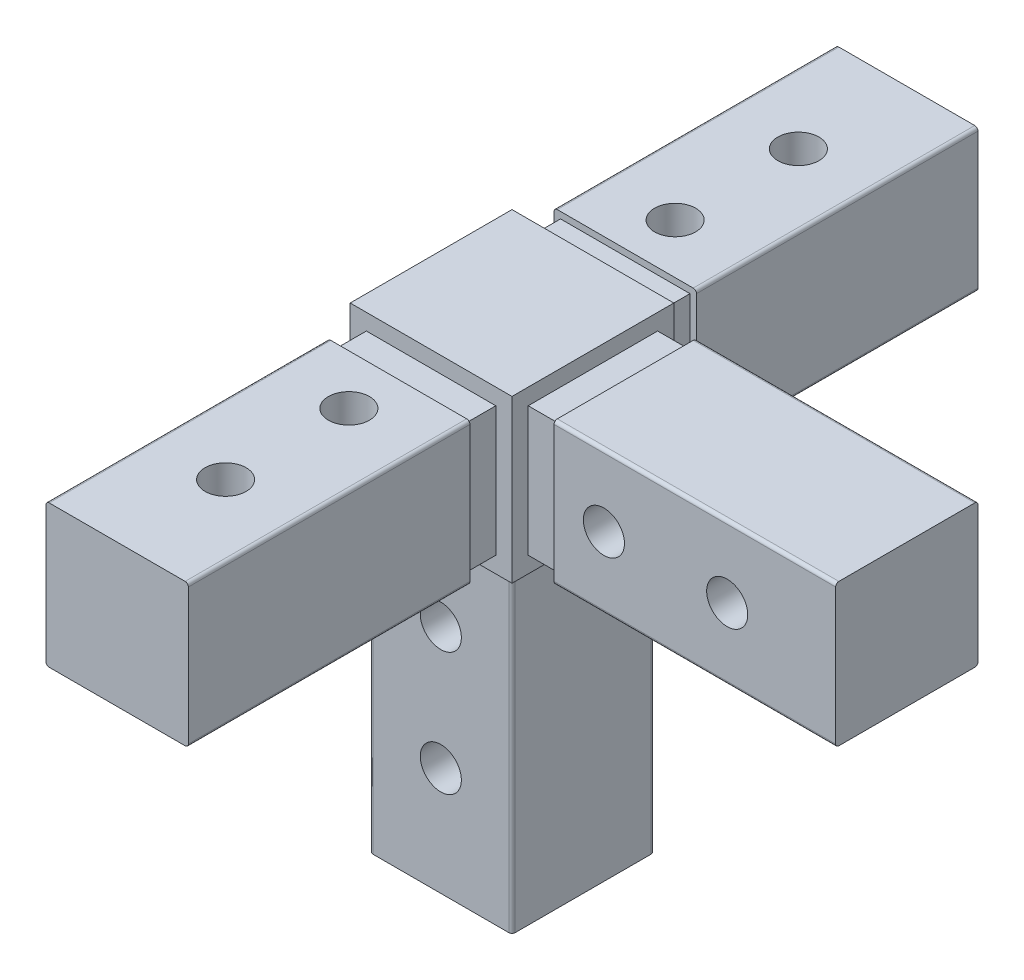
from build123d import *

# Parameters (mm, degrees)
SKETCH1_W            = 22.5
SKETCH1_H            = 30
BOSS_EXTRUDE1_DEPTH  = 20
SKETCH2_W            = 5
SKETCH2_H            = 20
CUT_EXTRUDE1_DEPTH   = 2.5
SKETCH3_W            = 20
SKETCH3_H            = 20
BOSS_EXTRUDE2_DEPTH  = 5
SKETCH4_W            = 21
SKETCH4_H            = 21
BOSS_EXTRUDE3_DEPTH  = 43.5
SKETCH5_W            = 22
SKETCH5_H            = 22
BOSS_EXTRUDE4_DEPTH  = 43.5
SKETCH6_W            = 22.5
SKETCH6_H            = 25
BOSS_EXTRUDE5_DEPTH  = 2.5
SKETCH7_W            = 25
SKETCH7_H            = 22.5
BOSS_EXTRUDE6_DEPTH  = 2.5
SKETCH8_W            = 25
SKETCH8_H            = 25
BOSS_EXTRUDE7_DEPTH  = 2.5
SKETCH9_W            = 20
SKETCH9_H            = 20
BOSS_EXTRUDE8_DEPTH  = 48.5
SKETCH10_W           = 20
SKETCH10_H           = 43.5
BOSS_EXTRUDE9_DEPTH  = 1
SKETCH11_W           = 43.5
SKETCH11_H           = 21
BOSS_EXTRUDE10_DEPTH = 1
SKETCH12_W           = 21
SKETCH12_H           = 43.5
BOSS_EXTRUDE11_DEPTH = 1
SKETCH13_W           = 43.5
SKETCH13_H           = 22
BOSS_EXTRUDE12_DEPTH = 1
SKETCH14_W           = 43.5
SKETCH14_H           = 21
BOSS_EXTRUDE13_DEPTH = 1
SKETCH15_W           = 43.5
SKETCH15_H           = 22
BOSS_EXTRUDE14_DEPTH = 1
SKETCH16_W           = 22
SKETCH16_H           = 22
BOSS_EXTRUDE15_DEPTH = 48.5
FILLET1_R            = 0.5
SKETCH17_R           = 3.175
CUT_EXTRUDE2_DEPTH   = 22
SKETCH18_R           = 3.175
CUT_EXTRUDE3_DEPTH   = 22


with BuildPart() as part:
    # Sketch1 → Boss-Extrude1 (new body)
    with BuildSketch(Plane.XZ.offset(10)):
        with Locations((1.25, -2.5)):
            Rectangle(SKETCH1_W, SKETCH1_H)
    extrude(amount=-BOSS_EXTRUDE1_DEPTH)

    # Sketch2 → Cut-Extrude1 (cut)
    with BuildSketch(Plane(origin=(12.5, 0, 0), x_dir=(0, 0, -1), z_dir=(1, 0, 0))):
        with Locations((15, 0)):
            Rectangle(SKETCH2_W, SKETCH2_H)
    extrude(amount=-CUT_EXTRUDE1_DEPTH, mode=Mode.SUBTRACT)

    # Sketch3 → Boss-Extrude2 (add)
    with BuildSketch(Plane(origin=(12.5, 0, 0), x_dir=(0, 0, -1), z_dir=(1, 0, 0))):
        Rectangle(SKETCH3_W, SKETCH3_H)
    extrude(amount=BOSS_EXTRUDE2_DEPTH)

    # Sketch4 → Boss-Extrude3 (add)
    with BuildSketch(Plane(origin=(17.5, 0, 0), x_dir=(0, 0, -1), z_dir=(1, 0, 0))):
        with Locations((0.5, 0.5)):
            Rectangle(SKETCH4_W, SKETCH4_H)
    extrude(amount=BOSS_EXTRUDE3_DEPTH)

    # Sketch5 → Boss-Extrude4 (add)
    with BuildSketch(Plane.XY.offset(-17.5)):
        Rectangle(SKETCH5_W, SKETCH5_H)
    extrude(amount=-BOSS_EXTRUDE4_DEPTH)

    # Sketch6 → Boss-Extrude5 (add)
    with BuildSketch(Plane.XZ.offset(10)):
        with Locations((1.25, 0)):
            Rectangle(SKETCH6_W, SKETCH6_H)
    extrude(amount=BOSS_EXTRUDE5_DEPTH)

    # Sketch7 → Boss-Extrude6 (add)
    with BuildSketch(Plane.ZY.offset(10)):
        with Locations((0, -1.25)):
            Rectangle(SKETCH7_W, SKETCH7_H)
    extrude(amount=BOSS_EXTRUDE6_DEPTH)

    # Sketch8 → Boss-Extrude7 (add)
    with BuildSketch(Plane(origin=(0, 10, 0), x_dir=(-1, 0, 0), z_dir=(0, 1, 0))):
        Rectangle(SKETCH8_W, SKETCH8_H)
    extrude(amount=BOSS_EXTRUDE7_DEPTH)

    # Sketch9 → Boss-Extrude8 (add)
    with BuildSketch(Plane.XY.offset(12.5)):
        Rectangle(SKETCH9_W, SKETCH9_H)
    extrude(amount=BOSS_EXTRUDE8_DEPTH)

    # Sketch10 → Boss-Extrude9 (add)
    with BuildSketch(Plane(origin=(0, 10, 0), x_dir=(-1, 0, 0), z_dir=(0, 1, 0))):
        with Locations((0, 39.25)):
            Rectangle(SKETCH10_W, SKETCH10_H)
    extrude(amount=BOSS_EXTRUDE9_DEPTH)

    # Sketch11 → Boss-Extrude10 (add)
    with BuildSketch(Plane(origin=(10, 0, 0), x_dir=(0, 0, -1), z_dir=(1, 0, 0))):
        with Locations((-39.25, 0.5)):
            Rectangle(SKETCH11_W, SKETCH11_H)
    extrude(amount=BOSS_EXTRUDE10_DEPTH)

    # Sketch12 → Boss-Extrude11 (add)
    with BuildSketch(Plane.XZ.offset(10)):
        with Locations((0.5, 39.25)):
            Rectangle(SKETCH12_W, SKETCH12_H)
    extrude(amount=BOSS_EXTRUDE11_DEPTH)

    # Sketch13 → Boss-Extrude12 (add)
    with BuildSketch(Plane.ZY.offset(10)):
        with Locations((39.25, 0)):
            Rectangle(SKETCH13_W, SKETCH13_H)
    extrude(amount=BOSS_EXTRUDE12_DEPTH)

    # Sketch14 → Boss-Extrude13 (add)
    with BuildSketch(Plane.XZ.offset(10)):
        with Locations((39.25, -0.5)):
            Rectangle(SKETCH14_W, SKETCH14_H)
    extrude(amount=BOSS_EXTRUDE13_DEPTH)

    # Sketch15 → Boss-Extrude14 (add)
    with BuildSketch(Plane.XY.offset(10)):
        with Locations((39.25, 0)):
            Rectangle(SKETCH15_W, SKETCH15_H)
    extrude(amount=BOSS_EXTRUDE14_DEPTH)

    # Sketch16 → Boss-Extrude15 (add)
    with BuildSketch(Plane.XZ.offset(12.5)):
        Rectangle(SKETCH16_W, SKETCH16_H)
    extrude(amount=BOSS_EXTRUDE15_DEPTH)

    # Fillet1
    fillet1_edges = [part.edges().sort_by_distance(p)[0] for p in [
        (11, 11, 39.25),
        (11, -11, 39.25),
        (-11, 11, 39.25),
        (-11, -11, 39.25),
        (39.25, -11, -11),
        (39.25, 11, 11),
        (39.25, -11, 11),
        (-11, -36.75, 11),
        (-11, -36.75, -11),
        (11, -36.75, -11),
        (11, -36.75, 11),
        (39.25, 11, -11),
        (-11, 11, -39.25),
        (11, 11, -39.25),
        (11, -11, -39.25),
        (-11, -11, -39.25),
    ]]
    fillet(fillet1_edges, radius=FILLET1_R)

    # Sketch17 → Cut-Extrude2 (cut)
    with BuildSketch(Plane.XZ.offset(11)):
        with Locations(Location((0, -25.2, 0), (0, 0, 270))):
            Circle(SKETCH17_R)
        with Locations(Location((0, -44.25, 0), (0, 0, 270))):
            Circle(SKETCH17_R)
        with Locations(Location((0, 25.2, 0), (0, 0, 270))):
            Circle(SKETCH17_R)
        with Locations(Location((0, 44.25, 0), (0, 0, 270))):
            Circle(SKETCH17_R)
    extrude(amount=-CUT_EXTRUDE2_DEPTH, mode=Mode.SUBTRACT)

    # Sketch18 → Cut-Extrude3 (cut)
    with BuildSketch(Plane.XY.offset(11)):
        with Locations((0, -25.2)):
            Circle(SKETCH18_R)
        with Locations((0, -44.25)):
            Circle(SKETCH18_R)
        with Locations((25.2, 0)):
            Circle(SKETCH18_R)
        with Locations((44.25, 0)):
            Circle(SKETCH18_R)
    extrude(amount=-CUT_EXTRUDE3_DEPTH, mode=Mode.SUBTRACT)


solid = part.part
